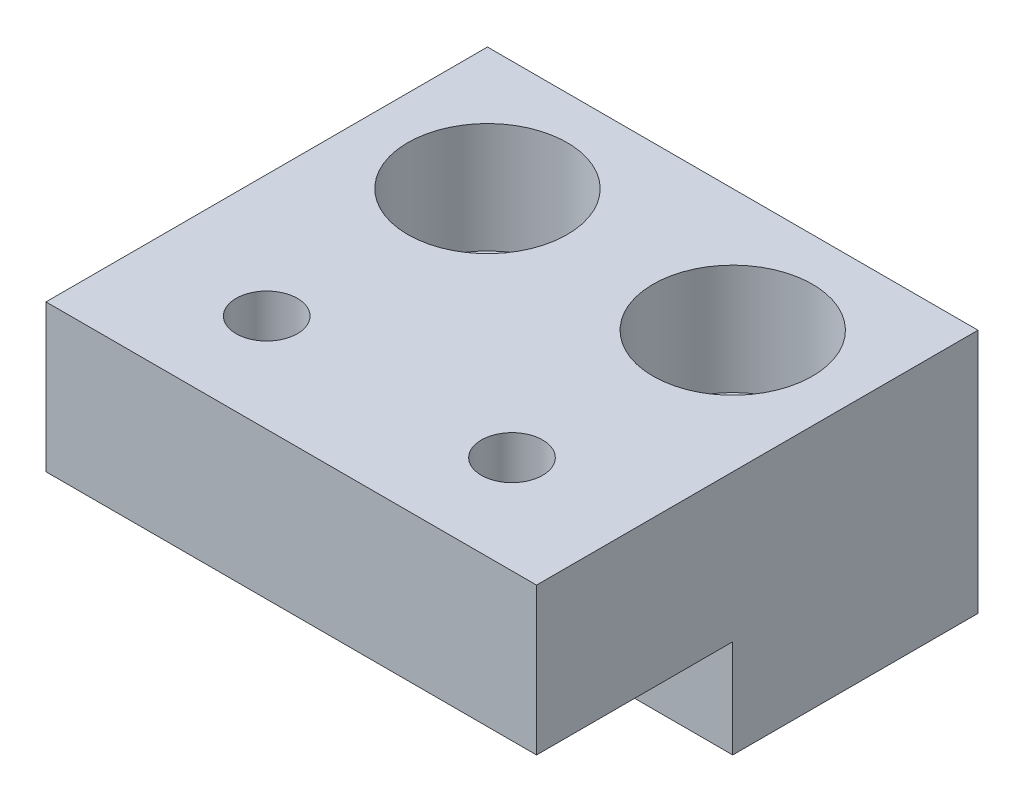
from build123d import *

# Parameters (mm, degrees)
SKETCH_1_W               = 20
SKETCH_1_H               = 18
SKETCH_1_R               = 1.75
SKETCH_1_R_2             = 1.25
EXTRUDE_1_DEPTH          = 10
SKETCH_2_R               = 3.25
CUT_EXTRUDE_1_DEPTH      = 4.5
CUT_EXTRUDE_2_DEPTH      = 29.705400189
CUT_EXTRUDE_2_DEPTH_BACK = 29.705400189


with BuildPart() as part:
    # Sketch 1 → Extrude 1 (new body)
    with BuildSketch(Plane(origin=(0, 0, 0), x_dir=(1, 0, 0), z_dir=(0, 1, 0))):
        with Locations((10, -9)):
            Rectangle(SKETCH_1_W, SKETCH_1_H)
        with Locations(Location((5, -5, 0), (0, 0, 270))):
            Circle(SKETCH_1_R, mode=Mode.SUBTRACT)
        with Locations(Location((15, -5, 0), (0, 0, 270))):
            Circle(SKETCH_1_R, mode=Mode.SUBTRACT)
        with Locations(Location((5, -14, 0), (0, 0, 270))):
            Circle(SKETCH_1_R_2, mode=Mode.SUBTRACT)
        with Locations(Location((15, -14, 0), (0, 0, 270))):
            Circle(SKETCH_1_R_2, mode=Mode.SUBTRACT)
    extrude(amount=EXTRUDE_1_DEPTH)

    # Sketch 2 → Cut-Extrude 1 (cut)
    with BuildSketch(Plane(origin=(0, 10, 0), x_dir=(1, 0, 0), z_dir=(0, 1, 0))):
        with Locations(Location((5, -5, 0), (0, 0, 270))):
            Circle(SKETCH_2_R)
        with Locations(Location((15, -5, 0), (0, 0, 270))):
            Circle(SKETCH_2_R)
    extrude(amount=-CUT_EXTRUDE_1_DEPTH, mode=Mode.SUBTRACT)

    # Sketch 3 → Cut-Extrude 2 (cut, two sides: drawn at the far end of the back side and taken through both)
    with BuildSketch(Plane(origin=(20, 0, 0), x_dir=(0, 0, -1), z_dir=(1, 0, 0)).offset(-CUT_EXTRUDE_2_DEPTH_BACK)):
        Polygon((-10, -47.947331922), (-10, 0), (-10, 4), (-18, 4), (-65.947331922, 4), (-131.196423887, -66.273341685), (-75.249091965, -118.220673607), align=None)
    extrude(amount=CUT_EXTRUDE_2_DEPTH + CUT_EXTRUDE_2_DEPTH_BACK, mode=Mode.SUBTRACT)


solid = part.part
